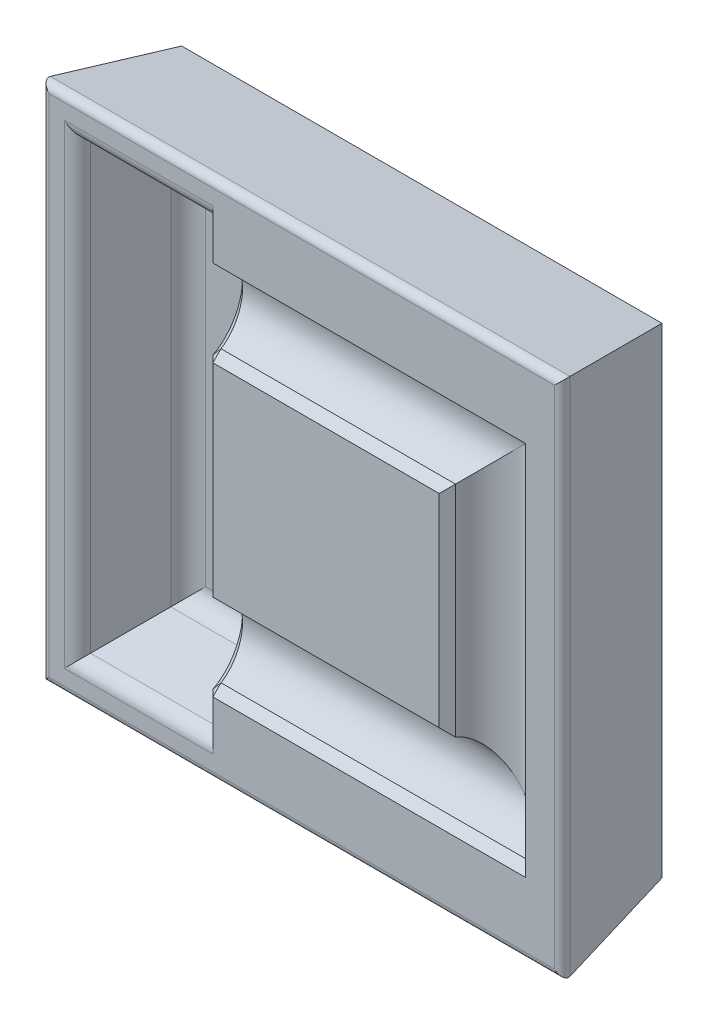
ISO-10303-21;
HEADER;
FILE_DESCRIPTION(('STEP AP214'),'2;1');
FILE_NAME('part.step','',(''),(''),'','','');
FILE_SCHEMA(('AUTOMOTIVE_DESIGN { 1 0 10303 214 1 1 1 1 }'));
ENDSEC;
DATA;
#1=APPLICATION_CONTEXT('core data for automotive mechanical design processes');
#2=APPLICATION_PROTOCOL_DEFINITION('international standard','automotive_design',2000,#1);
#3=PRODUCT_CONTEXT('',#1,'mechanical');
#4=PRODUCT('Part','Part','',(#3));
#5=PRODUCT_RELATED_PRODUCT_CATEGORY('part','',(#4));
#6=PRODUCT_DEFINITION_FORMATION('','',#4);
#7=PRODUCT_DEFINITION_CONTEXT('part definition',#1,'design');
#8=PRODUCT_DEFINITION('design','',#6,#7);
#9=PRODUCT_DEFINITION_SHAPE('','',#8);
#10=(LENGTH_UNIT() NAMED_UNIT(*) SI_UNIT(.MILLI.,.METRE.));
#11=(NAMED_UNIT(*) PLANE_ANGLE_UNIT() SI_UNIT($,.RADIAN.));
#12=(NAMED_UNIT(*) SI_UNIT($,.STERADIAN.) SOLID_ANGLE_UNIT());
#13=UNCERTAINTY_MEASURE_WITH_UNIT(LENGTH_MEASURE(1.E-05),#10,'distance_accuracy_value','');
#14=(GEOMETRIC_REPRESENTATION_CONTEXT(3) GLOBAL_UNCERTAINTY_ASSIGNED_CONTEXT((#13)) GLOBAL_UNIT_ASSIGNED_CONTEXT((#10,
#11,#12)) REPRESENTATION_CONTEXT('',''));
#15=CARTESIAN_POINT('',(0.,0.,0.));
#16=DIRECTION('',(0.,0.,1.));
#17=DIRECTION('',(1.,0.,0.));
#18=AXIS2_PLACEMENT_3D('',#15,#16,#17);
#19=CARTESIAN_POINT('',(-100.,-100.,50.));
#20=DIRECTION('',(0.,0.,1.));
#21=DIRECTION('',(1.,0.,0.));
#22=AXIS2_PLACEMENT_3D('',#19,#20,#21);
#23=PLANE('',#22);
#24=DIRECTION('',(0.,-1.,0.));
#25=VECTOR('',#24,1.);
#26=CARTESIAN_POINT('',(-37.,-98.8509468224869,50.));
#27=LINE('',#26,#25);
#28=CARTESIAN_POINT('',(-37.,-78.2410882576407,50.));
#29=VERTEX_POINT('',#28);
#30=CARTESIAN_POINT('',(-37.,-98.8509468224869,50.));
#31=VERTEX_POINT('',#30);
#32=EDGE_CURVE('E727',#29,#31,#27,.T.);
#33=ORIENTED_EDGE('',*,*,#32,.T.);
#34=DIRECTION('',(1.,0.,0.));
#35=VECTOR('',#34,1.);
#36=CARTESIAN_POINT('',(-93.8163490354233,-98.8509468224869,50.));
#37=LINE('',#36,#35);
#38=CARTESIAN_POINT('',(-98.8509468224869,-98.8509468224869,50.));
#39=VERTEX_POINT('',#38);
#40=EDGE_CURVE('E564',#31,#39,#37,.F.);
#41=ORIENTED_EDGE('',*,*,#40,.T.);
#42=DIRECTION('',(0.,-1.,0.));
#43=VECTOR('',#42,1.);
#44=CARTESIAN_POINT('',(-98.850946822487,93.8163490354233,50.));
#45=LINE('',#44,#43);
#46=CARTESIAN_POINT('',(-98.850946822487,98.8509468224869,50.));
#47=VERTEX_POINT('',#46);
#48=EDGE_CURVE('E531',#39,#47,#45,.F.);
#49=ORIENTED_EDGE('',*,*,#48,.T.);
#50=DIRECTION('',(-1.,0.,0.));
#51=VECTOR('',#50,1.);
#52=CARTESIAN_POINT('',(-40.,98.8509468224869,50.));
#53=LINE('',#52,#51);
#54=CARTESIAN_POINT('',(-37.,98.8509468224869,50.));
#55=VERTEX_POINT('',#54);
#56=EDGE_CURVE('E562',#47,#55,#53,.F.);
#57=ORIENTED_EDGE('',*,*,#56,.T.);
#58=DIRECTION('',(0.,-1.,0.));
#59=VECTOR('',#58,1.);
#60=CARTESIAN_POINT('',(-37.,75.2410882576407,50.));
#61=LINE('',#60,#59);
#62=CARTESIAN_POINT('',(-37.,78.2410882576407,50.));
#63=VERTEX_POINT('',#62);
#64=EDGE_CURVE('E1107',#55,#63,#61,.T.);
#65=ORIENTED_EDGE('',*,*,#64,.T.);
#66=DIRECTION('',(1.,0.,0.));
#67=VECTOR('',#66,1.);
#68=CARTESIAN_POINT('',(90.2410882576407,78.2410882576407,50.));
#69=LINE('',#68,#67);
#70=CARTESIAN_POINT('',(93.2410882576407,78.2410882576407,50.));
#71=VERTEX_POINT('',#70);
#72=EDGE_CURVE('E1105',#63,#71,#69,.T.);
#73=ORIENTED_EDGE('',*,*,#72,.T.);
#74=DIRECTION('',(0.,-1.,0.));
#75=VECTOR('',#74,1.);
#76=CARTESIAN_POINT('',(93.2410882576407,-100.,50.));
#77=LINE('',#76,#75);
#78=CARTESIAN_POINT('',(93.2410882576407,-78.2410882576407,50.));
#79=VERTEX_POINT('',#78);
#80=EDGE_CURVE('E953',#71,#79,#77,.T.);
#81=ORIENTED_EDGE('',*,*,#80,.T.);
#82=DIRECTION('',(-1.,0.,0.));
#83=VECTOR('',#82,1.);
#84=CARTESIAN_POINT('',(-40.,-78.2410882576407,50.));
#85=LINE('',#84,#83);
#86=EDGE_CURVE('E949',#79,#29,#85,.T.);
#87=ORIENTED_EDGE('',*,*,#86,.T.);
#88=EDGE_LOOP('',(#33,#41,#49,#57,#65,#73,#81,#87));
#89=FACE_BOUND('',#88,.T.);
#90=DIRECTION('',(1.,0.,0.));
#91=VECTOR('',#90,1.);
#92=CARTESIAN_POINT('',(-108.816349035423,105.241088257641,50.));
#93=LINE('',#92,#91);
#94=CARTESIAN_POINT('',(105.241088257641,105.241088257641,50.));
#95=VERTEX_POINT('',#94);
#96=CARTESIAN_POINT('',(-105.241088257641,105.241088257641,50.));
#97=VERTEX_POINT('',#96);
#98=EDGE_CURVE('E566',#95,#97,#93,.F.);
#99=ORIENTED_EDGE('',*,*,#98,.T.);
#100=DIRECTION('',(0.,1.,0.));
#101=VECTOR('',#100,1.);
#102=CARTESIAN_POINT('',(-105.241088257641,-108.816349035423,50.));
#103=LINE('',#102,#101);
#104=CARTESIAN_POINT('',(-105.241088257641,-105.241088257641,50.));
#105=VERTEX_POINT('',#104);
#106=EDGE_CURVE('E572',#97,#105,#103,.F.);
#107=ORIENTED_EDGE('',*,*,#106,.T.);
#108=DIRECTION('',(-1.,0.,0.));
#109=VECTOR('',#108,1.);
#110=CARTESIAN_POINT('',(108.816349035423,-105.241088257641,50.));
#111=LINE('',#110,#109);
#112=CARTESIAN_POINT('',(105.241088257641,-105.241088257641,50.));
#113=VERTEX_POINT('',#112);
#114=EDGE_CURVE('E570',#105,#113,#111,.F.);
#115=ORIENTED_EDGE('',*,*,#114,.T.);
#116=DIRECTION('',(0.,-1.,0.));
#117=VECTOR('',#116,1.);
#118=CARTESIAN_POINT('',(105.241088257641,108.816349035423,50.));
#119=LINE('',#118,#117);
#120=EDGE_CURVE('E568',#113,#95,#119,.F.);
#121=ORIENTED_EDGE('',*,*,#120,.T.);
#122=EDGE_LOOP('',(#99,#107,#115,#121));
#123=FACE_BOUND('',#122,.T.);
#124=ADVANCED_FACE('F352',(#89,#123),#23,.T.);
#125=CARTESIAN_POINT('',(-100.,100.,0.));
#126=DIRECTION('',(-0.984807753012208,0.,-0.173648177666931));
#127=DIRECTION('',(-0.173648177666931,0.,0.984807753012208));
#128=AXIS2_PLACEMENT_3D('',#125,#126,#127);
#129=PLANE('',#128);
#130=DIRECTION('',(0.171087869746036,0.171087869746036,-0.970287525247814));
#131=VECTOR('',#130,1.);
#132=CARTESIAN_POINT('',(-100.,-100.,0.));
#133=LINE('',#132,#131);
#134=CARTESIAN_POINT('',(-108.195511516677,-108.195511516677,46.4790554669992));
#135=VERTEX_POINT('',#134);
#136=CARTESIAN_POINT('',(-100.,-100.,0.));
#137=VERTEX_POINT('',#136);
#138=EDGE_CURVE('E520',#135,#137,#133,.T.);
#139=ORIENTED_EDGE('',*,*,#138,.F.);
#140=DIRECTION('',(0.,-1.,0.));
#141=VECTOR('',#140,1.);
#142=CARTESIAN_POINT('',(-108.195511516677,108.816349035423,46.4790554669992));
#143=LINE('',#142,#141);
#144=CARTESIAN_POINT('',(-108.195511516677,108.195511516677,46.4790554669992));
#145=VERTEX_POINT('',#144);
#146=EDGE_CURVE('E575',#135,#145,#143,.F.);
#147=ORIENTED_EDGE('',*,*,#146,.T.);
#148=DIRECTION('',(0.171087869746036,-0.171087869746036,-0.970287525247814));
#149=VECTOR('',#148,1.);
#150=CARTESIAN_POINT('',(-100.,100.,0.));
#151=LINE('',#150,#149);
#152=CARTESIAN_POINT('',(-100.,100.,0.));
#153=VERTEX_POINT('',#152);
#154=EDGE_CURVE('E544',#145,#153,#151,.T.);
#155=ORIENTED_EDGE('',*,*,#154,.T.);
#156=DIRECTION('',(0.,-1.,0.));
#157=VECTOR('',#156,1.);
#158=CARTESIAN_POINT('',(-100.,100.,0.));
#159=LINE('',#158,#157);
#160=EDGE_CURVE('E538',#153,#137,#159,.T.);
#161=ORIENTED_EDGE('',*,*,#160,.T.);
#162=EDGE_LOOP('',(#139,#147,#155,#161));
#163=FACE_BOUND('',#162,.T.);
#164=ADVANCED_FACE('F542',(#163),#129,.T.);
#165=CARTESIAN_POINT('',(-100.,-100.,0.));
#166=DIRECTION('',(0.,-0.984807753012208,-0.173648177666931));
#167=DIRECTION('',(0.,0.173648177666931,-0.984807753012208));
#168=AXIS2_PLACEMENT_3D('',#165,#166,#167);
#169=PLANE('',#168);
#170=DIRECTION('',(-0.171087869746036,0.171087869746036,-0.970287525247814));
#171=VECTOR('',#170,1.);
#172=CARTESIAN_POINT('',(94.1457881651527,-94.1457881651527,-33.2008851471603));
#173=LINE('',#172,#171);
#174=CARTESIAN_POINT('',(108.195511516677,-108.195511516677,46.4790554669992));
#175=VERTEX_POINT('',#174);
#176=CARTESIAN_POINT('',(100.,-100.,0.));
#177=VERTEX_POINT('',#176);
#178=EDGE_CURVE('E532',#175,#177,#173,.T.);
#179=ORIENTED_EDGE('',*,*,#178,.F.);
#180=DIRECTION('',(1.,0.,0.));
#181=VECTOR('',#180,1.);
#182=CARTESIAN_POINT('',(-108.816349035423,-108.195511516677,46.4790554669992));
#183=LINE('',#182,#181);
#184=EDGE_CURVE('E526',#175,#135,#183,.F.);
#185=ORIENTED_EDGE('',*,*,#184,.T.);
#186=ORIENTED_EDGE('',*,*,#138,.T.);
#187=DIRECTION('',(1.,0.,0.));
#188=VECTOR('',#187,1.);
#189=CARTESIAN_POINT('',(-100.,-100.,0.));
#190=LINE('',#189,#188);
#191=EDGE_CURVE('E523',#137,#177,#190,.T.);
#192=ORIENTED_EDGE('',*,*,#191,.T.);
#193=EDGE_LOOP('',(#179,#185,#186,#192));
#194=FACE_BOUND('',#193,.T.);
#195=ADVANCED_FACE('F354',(#194),#169,.T.);
#196=CARTESIAN_POINT('',(100.,100.,0.));
#197=DIRECTION('',(0.984807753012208,0.,-0.173648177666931));
#198=DIRECTION('',(-0.173648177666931,0.,-0.984807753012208));
#199=AXIS2_PLACEMENT_3D('',#196,#197,#198);
#200=PLANE('',#199);
#201=DIRECTION('',(-0.171087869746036,-0.171087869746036,-0.970287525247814));
#202=VECTOR('',#201,1.);
#203=CARTESIAN_POINT('',(94.1457881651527,94.1457881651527,-33.2008851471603));
#204=LINE('',#203,#202);
#205=CARTESIAN_POINT('',(108.195511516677,108.195511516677,46.4790554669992));
#206=VERTEX_POINT('',#205);
#207=CARTESIAN_POINT('',(100.,100.,0.));
#208=VERTEX_POINT('',#207);
#209=EDGE_CURVE('E558',#206,#208,#204,.T.);
#210=ORIENTED_EDGE('',*,*,#209,.F.);
#211=DIRECTION('',(0.,1.,0.));
#212=VECTOR('',#211,1.);
#213=CARTESIAN_POINT('',(108.195511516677,-108.816349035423,46.4790554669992));
#214=LINE('',#213,#212);
#215=EDGE_CURVE('E578',#206,#175,#214,.F.);
#216=ORIENTED_EDGE('',*,*,#215,.T.);
#217=ORIENTED_EDGE('',*,*,#178,.T.);
#218=DIRECTION('',(0.,1.,0.));
#219=VECTOR('',#218,1.);
#220=CARTESIAN_POINT('',(100.,100.,0.));
#221=LINE('',#220,#219);
#222=EDGE_CURVE('E540',#177,#208,#221,.T.);
#223=ORIENTED_EDGE('',*,*,#222,.T.);
#224=EDGE_LOOP('',(#210,#216,#217,#223));
#225=FACE_BOUND('',#224,.T.);
#226=ADVANCED_FACE('F1073',(#225),#200,.T.);
#227=CARTESIAN_POINT('',(-100.,100.,0.));
#228=DIRECTION('',(0.,0.984807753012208,-0.173648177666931));
#229=DIRECTION('',(0.,0.173648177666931,0.984807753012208));
#230=AXIS2_PLACEMENT_3D('',#227,#228,#229);
#231=PLANE('',#230);
#232=ORIENTED_EDGE('',*,*,#154,.F.);
#233=DIRECTION('',(-1.,0.,0.));
#234=VECTOR('',#233,1.);
#235=CARTESIAN_POINT('',(108.816349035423,108.195511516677,46.4790554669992));
#236=LINE('',#235,#234);
#237=EDGE_CURVE('E580',#145,#206,#236,.F.);
#238=ORIENTED_EDGE('',*,*,#237,.T.);
#239=ORIENTED_EDGE('',*,*,#209,.T.);
#240=DIRECTION('',(-1.,0.,0.));
#241=VECTOR('',#240,1.);
#242=CARTESIAN_POINT('',(-100.,100.,0.));
#243=LINE('',#242,#241);
#244=EDGE_CURVE('E555',#208,#153,#243,.T.);
#245=ORIENTED_EDGE('',*,*,#244,.T.);
#246=EDGE_LOOP('',(#232,#238,#239,#245));
#247=FACE_BOUND('',#246,.T.);
#248=ADVANCED_FACE('F1067',(#247),#231,.T.);
#249=DIRECTION('',(0.,-1.,0.));
#250=VECTOR('',#249,1.);
#251=CARTESIAN_POINT('',(-37.,-45.2410882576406,50.));
#252=LINE('',#251,#250);
#253=CARTESIAN_POINT('',(-37.,42.2410882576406,50.));
#254=VERTEX_POINT('',#253);
#255=CARTESIAN_POINT('',(-37.,-42.2410882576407,50.));
#256=VERTEX_POINT('',#255);
#257=EDGE_CURVE('E1009',#254,#256,#252,.T.);
#258=ORIENTED_EDGE('',*,*,#257,.T.);
#259=DIRECTION('',(1.,0.,0.));
#260=VECTOR('',#259,1.);
#261=CARTESIAN_POINT('',(60.2410882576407,-42.2410882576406,50.));
#262=LINE('',#261,#260);
#263=CARTESIAN_POINT('',(57.2410882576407,-42.2410882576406,50.));
#264=VERTEX_POINT('',#263);
#265=EDGE_CURVE('E1020',#256,#264,#262,.T.);
#266=ORIENTED_EDGE('',*,*,#265,.T.);
#267=DIRECTION('',(0.,1.,0.));
#268=VECTOR('',#267,1.);
#269=CARTESIAN_POINT('',(57.2410882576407,-100.,50.));
#270=LINE('',#269,#268);
#271=CARTESIAN_POINT('',(57.2410882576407,42.2410882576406,50.));
#272=VERTEX_POINT('',#271);
#273=EDGE_CURVE('E1018',#264,#272,#270,.T.);
#274=ORIENTED_EDGE('',*,*,#273,.T.);
#275=DIRECTION('',(-1.,0.,0.));
#276=VECTOR('',#275,1.);
#277=CARTESIAN_POINT('',(-40.,42.2410882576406,50.));
#278=LINE('',#277,#276);
#279=EDGE_CURVE('E1011',#272,#254,#278,.T.);
#280=ORIENTED_EDGE('',*,*,#279,.T.);
#281=EDGE_LOOP('',(#258,#266,#274,#280));
#282=FACE_BOUND('',#281,.T.);
#283=ADVANCED_FACE('F1061',(#282),#23,.T.);
#284=CARTESIAN_POINT('',(-100.,-100.,0.));
#285=DIRECTION('',(0.,0.,1.));
#286=DIRECTION('',(1.,0.,0.));
#287=AXIS2_PLACEMENT_3D('',#284,#285,#286);
#288=PLANE('',#287);
#289=ORIENTED_EDGE('',*,*,#160,.F.);
#290=ORIENTED_EDGE('',*,*,#244,.F.);
#291=ORIENTED_EDGE('',*,*,#222,.F.);
#292=ORIENTED_EDGE('',*,*,#191,.F.);
#293=EDGE_LOOP('',(#289,#290,#291,#292));
#294=FACE_BOUND('',#293,.T.);
#295=ADVANCED_FACE('F536',(#294),#288,.F.);
#296=CARTESIAN_POINT('',(-93.8163490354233,93.8163490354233,50.));
#297=DIRECTION('',(-0.984807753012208,0.,-0.173648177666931));
#298=DIRECTION('',(-0.173648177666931,0.,0.984807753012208));
#299=AXIS2_PLACEMENT_3D('',#296,#297,#298);
#300=PLANE('',#299);
#301=DIRECTION('',(-0.171087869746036,0.171087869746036,0.970287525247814));
#302=VECTOR('',#301,1.);
#303=CARTESIAN_POINT('',(-93.8163490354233,93.8163490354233,50.));
#304=LINE('',#303,#302);
#305=CARTESIAN_POINT('',(-87.9289347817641,87.9289347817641,16.6108145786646));
#306=VERTEX_POINT('',#305);
#307=CARTESIAN_POINT('',(-92.9421003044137,92.9421003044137,45.0418890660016));
#308=VERTEX_POINT('',#307);
#309=EDGE_CURVE('E546',#306,#308,#304,.T.);
#310=ORIENTED_EDGE('',*,*,#309,.T.);
#311=DIRECTION('',(0.,-1.,0.));
#312=VECTOR('',#311,1.);
#313=CARTESIAN_POINT('',(-92.9421003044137,-93.8163490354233,45.0418890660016));
#314=LINE('',#313,#312);
#315=CARTESIAN_POINT('',(-92.9421003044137,-92.9421003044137,45.0418890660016));
#316=VERTEX_POINT('',#315);
#317=EDGE_CURVE('E593',#308,#316,#314,.T.);
#318=ORIENTED_EDGE('',*,*,#317,.T.);
#319=DIRECTION('',(-0.171087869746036,-0.171087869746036,0.970287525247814));
#320=VECTOR('',#319,1.);
#321=CARTESIAN_POINT('',(-88.3241412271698,-88.3241412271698,18.8521417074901));
#322=LINE('',#321,#320);
#323=CARTESIAN_POINT('',(-87.9289347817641,-87.9289347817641,16.6108145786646));
#324=VERTEX_POINT('',#323);
#325=EDGE_CURVE('E918',#324,#316,#322,.T.);
#326=ORIENTED_EDGE('',*,*,#325,.F.);
#327=DIRECTION('',(0.,-1.,0.));
#328=VECTOR('',#327,1.);
#329=CARTESIAN_POINT('',(-87.9289347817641,93.8163490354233,16.6108145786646));
#330=LINE('',#329,#328);
#331=EDGE_CURVE('E591',#324,#306,#330,.F.);
#332=ORIENTED_EDGE('',*,*,#331,.T.);
#333=EDGE_LOOP('',(#310,#318,#326,#332));
#334=FACE_BOUND('',#333,.T.);
#335=ADVANCED_FACE('F684',(#334),#300,.F.);
#336=CARTESIAN_POINT('',(-93.8163490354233,93.8163490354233,50.));
#337=DIRECTION('',(0.,0.984807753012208,-0.173648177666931));
#338=DIRECTION('',(0.,0.173648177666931,0.984807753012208));
#339=AXIS2_PLACEMENT_3D('',#336,#337,#338);
#340=PLANE('',#339);
#341=DIRECTION('',(0.171087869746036,0.171087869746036,0.970287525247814));
#342=VECTOR('',#341,1.);
#343=CARTESIAN_POINT('',(-40.,93.8163490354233,50.));
#344=LINE('',#343,#342);
#345=CARTESIAN_POINT('',(-45.8874142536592,87.9289347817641,16.6108145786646));
#346=VERTEX_POINT('',#345);
#347=CARTESIAN_POINT('',(-40.8742487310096,92.9421003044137,45.0418890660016));
#348=VERTEX_POINT('',#347);
#349=EDGE_CURVE('E549',#346,#348,#344,.T.);
#350=ORIENTED_EDGE('',*,*,#349,.T.);
#351=DIRECTION('',(-1.,0.,0.));
#352=VECTOR('',#351,1.);
#353=CARTESIAN_POINT('',(-93.8163490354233,92.9421003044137,45.0418890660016));
#354=LINE('',#353,#352);
#355=EDGE_CURVE('E589',#348,#308,#354,.T.);
#356=ORIENTED_EDGE('',*,*,#355,.T.);
#357=ORIENTED_EDGE('',*,*,#309,.F.);
#358=DIRECTION('',(-1.,0.,0.));
#359=VECTOR('',#358,1.);
#360=CARTESIAN_POINT('',(-93.8163490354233,87.9289347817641,16.6108145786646));
#361=LINE('',#360,#359);
#362=EDGE_CURVE('E587',#306,#346,#361,.F.);
#363=ORIENTED_EDGE('',*,*,#362,.T.);
#364=EDGE_LOOP('',(#350,#356,#357,#363));
#365=FACE_BOUND('',#364,.T.);
#366=ADVANCED_FACE('F687',(#365),#340,.F.);
#367=CARTESIAN_POINT('',(-40.,93.8163490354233,50.));
#368=DIRECTION('',(0.984807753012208,0.,-0.173648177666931));
#369=DIRECTION('',(-0.173648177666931,0.,-0.984807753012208));
#370=AXIS2_PLACEMENT_3D('',#367,#368,#369);
#371=PLANE('',#370);
#372=CARTESIAN_POINT('',(-41.0579618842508,-98.8509468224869,44.));
#373=DIRECTION('',(0.984807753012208,0.,-0.173648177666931));
#374=DIRECTION('',(-0.173648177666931,0.,-0.984807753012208));
#375=AXIS2_PLACEMENT_3D('',#372,#373,#374);
#376=ELLIPSE('',#375,6.09255967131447,6.);
#377=CARTESIAN_POINT('',(-40.8742487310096,-92.9421003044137,45.0418890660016));
#378=VERTEX_POINT('',#377);
#379=CARTESIAN_POINT('',(-40.6422220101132,-93.3336211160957,46.3577779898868));
#380=VERTEX_POINT('',#379);
#381=EDGE_CURVE('E607',#378,#380,#376,.T.);
#382=ORIENTED_EDGE('',*,*,#381,.T.);
#383=DIRECTION('',(0.,1.,0.));
#384=VECTOR('',#383,1.);
#385=CARTESIAN_POINT('',(-40.6422220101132,-75.2410882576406,46.3577779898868));
#386=LINE('',#385,#384);
#387=CARTESIAN_POINT('',(-40.6422633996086,-79.04462382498,46.3575432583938));
#388=VERTEX_POINT('',#387);
#389=EDGE_CURVE('E367',#380,#388,#386,.T.);
#390=ORIENTED_EDGE('',*,*,#389,.T.);
#391=CARTESIAN_POINT('',(-40.1902283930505,-41.0335967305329,48.9211611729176));
#392=CARTESIAN_POINT('',(-41.0276289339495,-41.4427463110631,44.1720267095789));
#393=CARTESIAN_POINT('',(-41.8291016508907,-43.7115553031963,39.6266490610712));
#394=CARTESIAN_POINT('',(-42.6797222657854,-48.9856705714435,34.8025398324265));
#395=CARTESIAN_POINT('',(-42.9046233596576,-51.0416483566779,33.5270623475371));
#396=CARTESIAN_POINT('',(-43.2085258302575,-55.480556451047,31.8035457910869));
#397=CARTESIAN_POINT('',(-43.2871267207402,-57.8602053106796,31.3577779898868));
#398=CARTESIAN_POINT('',(-43.2871267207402,-62.6219712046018,31.3577779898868));
#399=CARTESIAN_POINT('',(-43.2085258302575,-65.0016200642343,31.8035457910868));
#400=CARTESIAN_POINT('',(-42.9046233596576,-69.4405281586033,33.527062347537));
#401=CARTESIAN_POINT('',(-42.6797222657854,-71.4965059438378,34.8025398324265));
#402=CARTESIAN_POINT('',(-41.8291016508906,-76.7706212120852,39.6266490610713));
#403=CARTESIAN_POINT('',(-41.0276289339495,-79.0394302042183,44.172026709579));
#404=CARTESIAN_POINT('',(-40.1902283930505,-79.4485797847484,48.9211611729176));
#405=B_SPLINE_CURVE_WITH_KNOTS('',3,(#391,#392,#393,#394,#395,#396,#397,#398,#399,#400,#401,
#402,#403,#404),.UNSPECIFIED.,.F.,.F.,(4,2,2,2,2,2,4),(4.80175394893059,5.54246962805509,
5.91282746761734,6.28318530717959,6.65354314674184,7.02390098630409,7.76461666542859),.UNSPECIFIED.);
#406=CARTESIAN_POINT('',(-40.6422327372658,-41.437462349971,46.3576705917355));
#407=VERTEX_POINT('',#406);
#408=EDGE_CURVE('E372',#388,#407,#405,.F.);
#409=ORIENTED_EDGE('',*,*,#408,.T.);
#410=DIRECTION('',(0.,1.,0.));
#411=VECTOR('',#410,1.);
#412=CARTESIAN_POINT('',(-40.6422220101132,45.2410882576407,46.3577779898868));
#413=LINE('',#412,#411);
#414=CARTESIAN_POINT('',(-40.6422427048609,41.438079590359,46.3576606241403));
#415=VERTEX_POINT('',#414);
#416=EDGE_CURVE('E752',#407,#415,#413,.T.);
#417=ORIENTED_EDGE('',*,*,#416,.T.);
#418=CARTESIAN_POINT('',(-40.1902283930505,79.4485797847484,48.9211611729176));
#419=CARTESIAN_POINT('',(-41.0276289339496,79.0394302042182,44.1720267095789));
#420=CARTESIAN_POINT('',(-41.8291016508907,76.770621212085,39.6266490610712));
#421=CARTESIAN_POINT('',(-42.6797222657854,71.4965059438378,34.8025398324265));
#422=CARTESIAN_POINT('',(-42.9046233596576,69.4405281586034,33.5270623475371));
#423=CARTESIAN_POINT('',(-43.2085258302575,65.0016200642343,31.8035457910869));
#424=CARTESIAN_POINT('',(-43.2871267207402,62.6219712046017,31.3577779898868));
#425=CARTESIAN_POINT('',(-43.2871267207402,57.8602053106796,31.3577779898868));
#426=CARTESIAN_POINT('',(-43.2085258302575,55.4805564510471,31.8035457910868));
#427=CARTESIAN_POINT('',(-42.9046233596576,51.041648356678,33.527062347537));
#428=CARTESIAN_POINT('',(-42.6797222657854,48.9856705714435,34.8025398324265));
#429=CARTESIAN_POINT('',(-41.8291016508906,43.7115553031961,39.6266490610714));
#430=CARTESIAN_POINT('',(-41.0276289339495,41.4427463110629,44.172026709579));
#431=CARTESIAN_POINT('',(-40.1902283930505,41.0335967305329,48.9211611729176));
#432=B_SPLINE_CURVE_WITH_KNOTS('',3,(#418,#419,#420,#421,#422,#423,#424,#425,#426,#427,#428,
#429,#430,#431),.UNSPECIFIED.,.F.,.F.,(4,2,2,2,2,2,4),(4.80175394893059,5.54246962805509,
5.91282746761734,6.28318530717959,6.65354314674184,7.02390098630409,7.76461666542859),.UNSPECIFIED.);
#433=CARTESIAN_POINT('',(-40.6422633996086,79.04462382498,46.3575432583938));
#434=VERTEX_POINT('',#433);
#435=EDGE_CURVE('E878',#415,#434,#432,.F.);
#436=ORIENTED_EDGE('',*,*,#435,.T.);
#437=DIRECTION('',(0.,1.,0.));
#438=VECTOR('',#437,1.);
#439=CARTESIAN_POINT('',(-40.6422220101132,98.8509468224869,46.3577779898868));
#440=LINE('',#439,#438);
#441=CARTESIAN_POINT('',(-40.6422220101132,93.3336211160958,46.3577779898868));
#442=VERTEX_POINT('',#441);
#443=EDGE_CURVE('E950',#434,#442,#440,.T.);
#444=ORIENTED_EDGE('',*,*,#443,.T.);
#445=CARTESIAN_POINT('',(-41.0579618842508,98.8509468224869,44.));
#446=DIRECTION('',(0.984807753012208,0.,-0.173648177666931));
#447=DIRECTION('',(0.173648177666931,0.,0.984807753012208));
#448=AXIS2_PLACEMENT_3D('',#445,#446,#447);
#449=ELLIPSE('',#448,6.09255967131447,6.);
#450=EDGE_CURVE('E609',#442,#348,#449,.T.);
#451=ORIENTED_EDGE('',*,*,#450,.T.);
#452=ORIENTED_EDGE('',*,*,#349,.F.);
#453=DIRECTION('',(0.,1.,0.));
#454=VECTOR('',#453,1.);
#455=CARTESIAN_POINT('',(-45.8874142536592,93.8163490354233,16.6108145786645));
#456=LINE('',#455,#454);
#457=CARTESIAN_POINT('',(-45.8874142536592,-87.9289347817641,16.6108145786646));
#458=VERTEX_POINT('',#457);
#459=EDGE_CURVE('E604',#346,#458,#456,.F.);
#460=ORIENTED_EDGE('',*,*,#459,.T.);
#461=DIRECTION('',(0.171087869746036,-0.171087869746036,0.970287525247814));
#462=VECTOR('',#461,1.);
#463=CARTESIAN_POINT('',(-41.5752615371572,-92.241087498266,41.0662478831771));
#464=LINE('',#463,#462);
#465=EDGE_CURVE('E723',#458,#378,#464,.T.);
#466=ORIENTED_EDGE('',*,*,#465,.T.);
#467=EDGE_LOOP('',(#382,#390,#409,#417,#436,#444,#451,#452,#460,#466));
#468=FACE_BOUND('',#467,.T.);
#469=ADVANCED_FACE('F691',(#468),#371,.F.);
#470=CARTESIAN_POINT('',(-93.8163490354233,-93.8163490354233,50.));
#471=DIRECTION('',(0.,-0.984807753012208,-0.173648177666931));
#472=DIRECTION('',(0.,0.173648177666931,-0.984807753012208));
#473=AXIS2_PLACEMENT_3D('',#470,#471,#472);
#474=PLANE('',#473);
#475=ORIENTED_EDGE('',*,*,#325,.T.);
#476=DIRECTION('',(1.,0.,0.));
#477=VECTOR('',#476,1.);
#478=CARTESIAN_POINT('',(-40.,-92.9421003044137,45.0418890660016));
#479=LINE('',#478,#477);
#480=EDGE_CURVE('E584',#316,#378,#479,.T.);
#481=ORIENTED_EDGE('',*,*,#480,.T.);
#482=ORIENTED_EDGE('',*,*,#465,.F.);
#483=DIRECTION('',(1.,0.,0.));
#484=VECTOR('',#483,1.);
#485=CARTESIAN_POINT('',(-93.8163490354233,-87.9289347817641,16.6108145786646));
#486=LINE('',#485,#484);
#487=EDGE_CURVE('E582',#458,#324,#486,.F.);
#488=ORIENTED_EDGE('',*,*,#487,.T.);
#489=EDGE_LOOP('',(#475,#481,#482,#488));
#490=FACE_BOUND('',#489,.T.);
#491=ADVANCED_FACE('F682',(#490),#474,.F.);
#492=CARTESIAN_POINT('',(-93.8163490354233,-93.8163490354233,10.));
#493=DIRECTION('',(0.,0.,1.));
#494=DIRECTION('',(1.,0.,0.));
#495=AXIS2_PLACEMENT_3D('',#492,#493,#494);
#496=PLANE('',#495);
#497=DIRECTION('',(1.,0.,0.));
#498=VECTOR('',#497,1.);
#499=CARTESIAN_POINT('',(-93.8163490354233,-80.0504727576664,10.));
#500=LINE('',#499,#498);
#501=CARTESIAN_POINT('',(-80.0504727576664,-80.0504727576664,10.));
#502=VERTEX_POINT('',#501);
#503=CARTESIAN_POINT('',(-53.7658762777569,-80.0504727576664,10.));
#504=VERTEX_POINT('',#503);
#505=EDGE_CURVE('E599',#502,#504,#500,.T.);
#506=ORIENTED_EDGE('',*,*,#505,.T.);
#507=DIRECTION('',(0.,1.,0.));
#508=VECTOR('',#507,1.);
#509=CARTESIAN_POINT('',(-53.7658762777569,-93.8163490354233,10.));
#510=LINE('',#509,#508);
#511=CARTESIAN_POINT('',(-53.7658762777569,80.0504727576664,10.));
#512=VERTEX_POINT('',#511);
#513=EDGE_CURVE('E601',#504,#512,#510,.T.);
#514=ORIENTED_EDGE('',*,*,#513,.T.);
#515=DIRECTION('',(-1.,0.,0.));
#516=VECTOR('',#515,1.);
#517=CARTESIAN_POINT('',(-93.8163490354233,80.0504727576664,10.));
#518=LINE('',#517,#516);
#519=CARTESIAN_POINT('',(-80.0504727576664,80.0504727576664,10.));
#520=VERTEX_POINT('',#519);
#521=EDGE_CURVE('E597',#512,#520,#518,.T.);
#522=ORIENTED_EDGE('',*,*,#521,.T.);
#523=DIRECTION('',(0.,-1.,0.));
#524=VECTOR('',#523,1.);
#525=CARTESIAN_POINT('',(-80.0504727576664,-93.8163490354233,10.));
#526=LINE('',#525,#524);
#527=EDGE_CURVE('E595',#520,#502,#526,.T.);
#528=ORIENTED_EDGE('',*,*,#527,.T.);
#529=EDGE_LOOP('',(#506,#514,#522,#528));
#530=FACE_BOUND('',#529,.T.);
#531=ADVANCED_FACE('F678',(#530),#496,.T.);
#532=CARTESIAN_POINT('',(105.241088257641,-100.,47.));
#533=DIRECTION('',(0.,1.,0.));
#534=DIRECTION('',(-1.,0.,0.));
#535=AXIS2_PLACEMENT_3D('',#532,#533,#534);
#536=CYLINDRICAL_SURFACE('',#535,3.);
#537=CARTESIAN_POINT('',(105.241088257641,-105.241088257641,47.));
#538=DIRECTION('',(0.707106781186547,0.707106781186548,0.));
#539=DIRECTION('',(-0.707106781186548,0.707106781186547,0.));
#540=AXIS2_PLACEMENT_3D('',#537,#538,#539);
#541=ELLIPSE('',#540,4.24264068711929,3.);
#542=EDGE_CURVE('E913',#175,#113,#541,.F.);
#543=ORIENTED_EDGE('',*,*,#542,.F.);
#544=ORIENTED_EDGE('',*,*,#215,.F.);
#545=CARTESIAN_POINT('',(105.241088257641,105.241088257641,47.));
#546=DIRECTION('',(-0.707106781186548,0.707106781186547,0.));
#547=DIRECTION('',(-0.707106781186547,-0.707106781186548,0.));
#548=AXIS2_PLACEMENT_3D('',#545,#546,#547);
#549=ELLIPSE('',#548,4.24264068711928,3.);
#550=EDGE_CURVE('E916',#95,#206,#549,.T.);
#551=ORIENTED_EDGE('',*,*,#550,.F.);
#552=ORIENTED_EDGE('',*,*,#120,.F.);
#553=EDGE_LOOP('',(#543,#544,#551,#552));
#554=FACE_BOUND('',#553,.T.);
#555=ADVANCED_FACE('F674',(#554),#536,.T.);
#556=CARTESIAN_POINT('',(-100.,105.241088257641,47.));
#557=DIRECTION('',(-1.,0.,0.));
#558=DIRECTION('',(0.,0.,1.));
#559=AXIS2_PLACEMENT_3D('',#556,#557,#558);
#560=CYLINDRICAL_SURFACE('',#559,3.);
#561=ORIENTED_EDGE('',*,*,#550,.T.);
#562=ORIENTED_EDGE('',*,*,#237,.F.);
#563=CARTESIAN_POINT('',(-105.241088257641,105.241088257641,47.));
#564=DIRECTION('',(-0.707106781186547,-0.707106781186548,0.));
#565=DIRECTION('',(-0.707106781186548,0.707106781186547,0.));
#566=AXIS2_PLACEMENT_3D('',#563,#564,#565);
#567=ELLIPSE('',#566,4.24264068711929,3.);
#568=EDGE_CURVE('E911',#97,#145,#567,.T.);
#569=ORIENTED_EDGE('',*,*,#568,.F.);
#570=ORIENTED_EDGE('',*,*,#98,.F.);
#571=EDGE_LOOP('',(#561,#562,#569,#570));
#572=FACE_BOUND('',#571,.T.);
#573=ADVANCED_FACE('F670',(#572),#560,.T.);
#574=CARTESIAN_POINT('',(-100.,-105.241088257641,47.));
#575=DIRECTION('',(1.,0.,0.));
#576=DIRECTION('',(0.,0.,-1.));
#577=AXIS2_PLACEMENT_3D('',#574,#575,#576);
#578=CYLINDRICAL_SURFACE('',#577,3.);
#579=ORIENTED_EDGE('',*,*,#542,.T.);
#580=ORIENTED_EDGE('',*,*,#114,.F.);
#581=CARTESIAN_POINT('',(-105.241088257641,-105.241088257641,47.));
#582=DIRECTION('',(0.707106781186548,-0.707106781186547,0.));
#583=DIRECTION('',(0.707106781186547,0.707106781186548,0.));
#584=AXIS2_PLACEMENT_3D('',#581,#582,#583);
#585=ELLIPSE('',#584,4.24264068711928,3.);
#586=EDGE_CURVE('E909',#135,#105,#585,.F.);
#587=ORIENTED_EDGE('',*,*,#586,.F.);
#588=ORIENTED_EDGE('',*,*,#184,.F.);
#589=EDGE_LOOP('',(#579,#580,#587,#588));
#590=FACE_BOUND('',#589,.T.);
#591=ADVANCED_FACE('F666',(#590),#578,.T.);
#592=CARTESIAN_POINT('',(-105.241088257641,-100.,47.));
#593=DIRECTION('',(0.,-1.,0.));
#594=DIRECTION('',(1.,0.,0.));
#595=AXIS2_PLACEMENT_3D('',#592,#593,#594);
#596=CYLINDRICAL_SURFACE('',#595,3.);
#597=ORIENTED_EDGE('',*,*,#568,.T.);
#598=ORIENTED_EDGE('',*,*,#146,.F.);
#599=ORIENTED_EDGE('',*,*,#586,.T.);
#600=ORIENTED_EDGE('',*,*,#106,.F.);
#601=EDGE_LOOP('',(#597,#598,#599,#600));
#602=FACE_BOUND('',#601,.T.);
#603=ADVANCED_FACE('F662',(#602),#596,.T.);
#604=CARTESIAN_POINT('',(-93.8163490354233,98.8509468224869,44.));
#605=DIRECTION('',(1.,0.,0.));
#606=DIRECTION('',(0.,0.,-1.));
#607=AXIS2_PLACEMENT_3D('',#604,#605,#606);
#608=CYLINDRICAL_SURFACE('',#607,6.);
#609=ORIENTED_EDGE('',*,*,#450,.F.);
#610=CARTESIAN_POINT('',(-43.,98.8509468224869,44.));
#611=DIRECTION('',(-0.707106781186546,0.,0.70710678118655));
#612=DIRECTION('',(0.70710678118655,0.,0.707106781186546));
#613=AXIS2_PLACEMENT_3D('',#610,#611,#612);
#614=ELLIPSE('',#613,8.48528137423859,6.);
#615=EDGE_CURVE('E12',#442,#55,#614,.T.);
#616=ORIENTED_EDGE('',*,*,#615,.T.);
#617=ORIENTED_EDGE('',*,*,#56,.F.);
#618=CARTESIAN_POINT('',(-98.850946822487,98.8509468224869,44.));
#619=DIRECTION('',(0.707106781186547,0.707106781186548,0.));
#620=DIRECTION('',(0.707106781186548,-0.707106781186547,0.));
#621=AXIS2_PLACEMENT_3D('',#618,#619,#620);
#622=ELLIPSE('',#621,8.48528137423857,6.);
#623=EDGE_CURVE('E906',#308,#47,#622,.F.);
#624=ORIENTED_EDGE('',*,*,#623,.F.);
#625=ORIENTED_EDGE('',*,*,#355,.F.);
#626=EDGE_LOOP('',(#609,#616,#617,#624,#625));
#627=FACE_BOUND('',#626,.T.);
#628=ADVANCED_FACE('F658',(#627),#608,.T.);
#629=CARTESIAN_POINT('',(-98.850946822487,93.8163490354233,44.));
#630=DIRECTION('',(0.,1.,0.));
#631=DIRECTION('',(-1.,0.,0.));
#632=AXIS2_PLACEMENT_3D('',#629,#630,#631);
#633=CYLINDRICAL_SURFACE('',#632,6.);
#634=ORIENTED_EDGE('',*,*,#623,.T.);
#635=ORIENTED_EDGE('',*,*,#48,.F.);
#636=CARTESIAN_POINT('',(-98.8509468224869,-98.8509468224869,44.));
#637=DIRECTION('',(-0.707106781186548,0.707106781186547,0.));
#638=DIRECTION('',(-0.707106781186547,-0.707106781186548,0.));
#639=AXIS2_PLACEMENT_3D('',#636,#637,#638);
#640=ELLIPSE('',#639,8.48528137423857,6.);
#641=EDGE_CURVE('E904',#316,#39,#640,.F.);
#642=ORIENTED_EDGE('',*,*,#641,.F.);
#643=ORIENTED_EDGE('',*,*,#317,.F.);
#644=EDGE_LOOP('',(#634,#635,#642,#643));
#645=FACE_BOUND('',#644,.T.);
#646=ADVANCED_FACE('F654',(#645),#633,.T.);
#647=CARTESIAN_POINT('',(-93.8163490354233,-98.8509468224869,44.));
#648=DIRECTION('',(-1.,0.,0.));
#649=DIRECTION('',(0.,0.,1.));
#650=AXIS2_PLACEMENT_3D('',#647,#648,#649);
#651=CYLINDRICAL_SURFACE('',#650,6.);
#652=ORIENTED_EDGE('',*,*,#641,.T.);
#653=ORIENTED_EDGE('',*,*,#40,.F.);
#654=CARTESIAN_POINT('',(-43.,-98.8509468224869,44.));
#655=DIRECTION('',(-0.707106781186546,0.,0.70710678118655));
#656=DIRECTION('',(-0.70710678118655,0.,-0.707106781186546));
#657=AXIS2_PLACEMENT_3D('',#654,#655,#656);
#658=ELLIPSE('',#657,8.48528137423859,6.);
#659=EDGE_CURVE('E360',#31,#380,#658,.T.);
#660=ORIENTED_EDGE('',*,*,#659,.T.);
#661=ORIENTED_EDGE('',*,*,#381,.F.);
#662=ORIENTED_EDGE('',*,*,#480,.F.);
#663=EDGE_LOOP('',(#652,#653,#660,#661,#662));
#664=FACE_BOUND('',#663,.T.);
#665=ADVANCED_FACE('F650',(#664),#651,.T.);
#666=CARTESIAN_POINT('',(-80.0504727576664,-93.8163490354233,18.));
#667=DIRECTION('',(0.,-1.,0.));
#668=DIRECTION('',(1.,0.,0.));
#669=AXIS2_PLACEMENT_3D('',#666,#667,#668);
#670=CYLINDRICAL_SURFACE('',#669,8.);
#671=CARTESIAN_POINT('',(-80.0504727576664,80.0504727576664,18.));
#672=DIRECTION('',(-0.707106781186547,-0.707106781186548,0.));
#673=DIRECTION('',(-0.707106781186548,0.707106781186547,0.));
#674=AXIS2_PLACEMENT_3D('',#671,#672,#673);
#675=ELLIPSE('',#674,11.3137084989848,8.);
#676=EDGE_CURVE('E898',#306,#520,#675,.T.);
#677=ORIENTED_EDGE('',*,*,#676,.F.);
#678=ORIENTED_EDGE('',*,*,#331,.F.);
#679=CARTESIAN_POINT('',(-80.0504727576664,-80.0504727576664,18.));
#680=DIRECTION('',(0.707106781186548,-0.707106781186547,0.));
#681=DIRECTION('',(0.707106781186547,0.707106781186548,0.));
#682=AXIS2_PLACEMENT_3D('',#679,#680,#681);
#683=ELLIPSE('',#682,11.3137084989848,8.);
#684=EDGE_CURVE('E901',#502,#324,#683,.F.);
#685=ORIENTED_EDGE('',*,*,#684,.F.);
#686=ORIENTED_EDGE('',*,*,#527,.F.);
#687=EDGE_LOOP('',(#677,#678,#685,#686));
#688=FACE_BOUND('',#687,.T.);
#689=ADVANCED_FACE('F646',(#688),#670,.F.);
#690=CARTESIAN_POINT('',(-93.8163490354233,-80.0504727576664,18.));
#691=DIRECTION('',(1.,0.,0.));
#692=DIRECTION('',(0.,0.,-1.));
#693=AXIS2_PLACEMENT_3D('',#690,#691,#692);
#694=CYLINDRICAL_SURFACE('',#693,8.);
#695=ORIENTED_EDGE('',*,*,#684,.T.);
#696=ORIENTED_EDGE('',*,*,#487,.F.);
#697=CARTESIAN_POINT('',(-53.7658762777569,-80.0504727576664,18.));
#698=DIRECTION('',(0.707106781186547,0.707106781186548,0.));
#699=DIRECTION('',(-0.707106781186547,0.707106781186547,0.));
#700=AXIS2_PLACEMENT_3D('',#697,#698,#699);
#701=ELLIPSE('',#700,11.3137084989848,8.);
#702=EDGE_CURVE('E896',#504,#458,#701,.F.);
#703=ORIENTED_EDGE('',*,*,#702,.F.);
#704=ORIENTED_EDGE('',*,*,#505,.F.);
#705=EDGE_LOOP('',(#695,#696,#703,#704));
#706=FACE_BOUND('',#705,.T.);
#707=ADVANCED_FACE('F642',(#706),#694,.F.);
#708=CARTESIAN_POINT('',(-93.8163490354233,80.0504727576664,18.));
#709=DIRECTION('',(-1.,0.,0.));
#710=DIRECTION('',(0.,0.,1.));
#711=AXIS2_PLACEMENT_3D('',#708,#709,#710);
#712=CYLINDRICAL_SURFACE('',#711,8.);
#713=ORIENTED_EDGE('',*,*,#676,.T.);
#714=ORIENTED_EDGE('',*,*,#521,.F.);
#715=CARTESIAN_POINT('',(-53.7658762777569,80.0504727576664,18.));
#716=DIRECTION('',(-0.707106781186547,0.707106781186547,0.));
#717=DIRECTION('',(0.707106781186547,0.707106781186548,0.));
#718=AXIS2_PLACEMENT_3D('',#715,#716,#717);
#719=ELLIPSE('',#718,11.3137084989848,8.);
#720=EDGE_CURVE('E894',#346,#512,#719,.T.);
#721=ORIENTED_EDGE('',*,*,#720,.F.);
#722=ORIENTED_EDGE('',*,*,#362,.F.);
#723=EDGE_LOOP('',(#713,#714,#721,#722));
#724=FACE_BOUND('',#723,.T.);
#725=ADVANCED_FACE('F638',(#724),#712,.F.);
#726=CARTESIAN_POINT('',(-53.7658762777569,-93.8163490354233,18.));
#727=DIRECTION('',(0.,1.,0.));
#728=DIRECTION('',(-1.,0.,0.));
#729=AXIS2_PLACEMENT_3D('',#726,#727,#728);
#730=CYLINDRICAL_SURFACE('',#729,8.);
#731=ORIENTED_EDGE('',*,*,#702,.T.);
#732=ORIENTED_EDGE('',*,*,#459,.F.);
#733=ORIENTED_EDGE('',*,*,#720,.T.);
#734=ORIENTED_EDGE('',*,*,#513,.F.);
#735=EDGE_LOOP('',(#731,#732,#733,#734));
#736=FACE_BOUND('',#735,.T.);
#737=ADVANCED_FACE('F634',(#736),#730,.F.);
#738=CARTESIAN_POINT('',(75.2410882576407,-60.2410882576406,50.));
#739=DIRECTION('',(-1.,0.,0.));
#740=DIRECTION('',(0.,-1.,0.));
#741=AXIS2_PLACEMENT_3D('',#738,#739,#740);
#742=CYLINDRICAL_SURFACE('',#741,15.);
#743=CARTESIAN_POINT('',(75.2410882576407,-60.2410882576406,50.));
#744=DIRECTION('',(-0.707106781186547,-0.707106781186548,0.));
#745=DIRECTION('',(0.707106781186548,-0.707106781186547,0.));
#746=AXIS2_PLACEMENT_3D('',#743,#744,#745);
#747=ELLIPSE('',#746,21.2132034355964,15.);
#748=CARTESIAN_POINT('',(60.6286021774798,-45.6286021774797,46.6124860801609));
#749=VERTEX_POINT('',#748);
#750=CARTESIAN_POINT('',(89.8535743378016,-74.8535743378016,46.6124860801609));
#751=VERTEX_POINT('',#750);
#752=EDGE_CURVE('E890',#749,#751,#747,.T.);
#753=ORIENTED_EDGE('',*,*,#752,.F.);
#754=DIRECTION('',(-1.,0.,0.));
#755=VECTOR('',#754,1.);
#756=CARTESIAN_POINT('',(75.2410882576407,-45.6286021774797,46.6124860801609));
#757=LINE('',#756,#755);
#758=CARTESIAN_POINT('',(-37.0124746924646,-45.6286014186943,46.6124893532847));
#759=VERTEX_POINT('',#758);
#760=EDGE_CURVE('E1006',#749,#759,#757,.T.);
#761=ORIENTED_EDGE('',*,*,#760,.T.);
#762=CARTESIAN_POINT('',(-36.5480063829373,-75.1812323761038,48.6613089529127));
#763=CARTESIAN_POINT('',(-37.3854069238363,-74.862983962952,44.9672943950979));
#764=CARTESIAN_POINT('',(-38.18687963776,-73.0982385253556,41.4317678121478));
#765=CARTESIAN_POINT('',(-39.0375002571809,-68.9958786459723,37.6794356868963));
#766=CARTESIAN_POINT('',(-39.2624013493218,-67.3966794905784,36.6873323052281));
#767=CARTESIAN_POINT('',(-39.5663038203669,-63.9439679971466,35.3467311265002));
#768=CARTESIAN_POINT('',(-39.644904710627,-62.0930080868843,35.));
#769=CARTESIAN_POINT('',(-39.644904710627,-58.3891684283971,35.));
#770=CARTESIAN_POINT('',(-39.5663038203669,-56.5382085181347,35.3467311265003));
#771=CARTESIAN_POINT('',(-39.2624013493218,-53.0854970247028,36.6873323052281));
#772=CARTESIAN_POINT('',(-39.037500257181,-51.486297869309,37.6794356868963));
#773=CARTESIAN_POINT('',(-38.1868796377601,-47.3839379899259,41.4317678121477));
#774=CARTESIAN_POINT('',(-37.3854069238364,-45.6191925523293,44.9672943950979));
#775=CARTESIAN_POINT('',(-36.5480063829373,-45.3009441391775,48.6613089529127));
#776=B_SPLINE_CURVE_WITH_KNOTS('',3,(#762,#763,#764,#765,#766,#767,#768,#769,#770,#771,#772,
#773,#774,#775),.UNSPECIFIED.,.F.,.F.,(4,2,2,2,2,2,4),(4.80175394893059,5.54246962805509,
5.91282746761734,6.28318530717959,6.65354314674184,7.02390098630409,7.76461666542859),.UNSPECIFIED.);
#777=CARTESIAN_POINT('',(-37.0124929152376,-74.8539367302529,46.6124089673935));
#778=VERTEX_POINT('',#777);
#779=EDGE_CURVE('E611',#759,#778,#776,.F.);
#780=ORIENTED_EDGE('',*,*,#779,.T.);
#781=DIRECTION('',(-1.,0.,0.));
#782=VECTOR('',#781,1.);
#783=CARTESIAN_POINT('',(75.2410882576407,-74.8535743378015,46.6124860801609));
#784=LINE('',#783,#782);
#785=EDGE_CURVE('E621',#778,#751,#784,.F.);
#786=ORIENTED_EDGE('',*,*,#785,.T.);
#787=EDGE_LOOP('',(#753,#761,#780,#786));
#788=FACE_BOUND('',#787,.T.);
#789=ADVANCED_FACE('F623',(#788),#742,.F.);
#790=CARTESIAN_POINT('',(75.2410882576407,60.2410882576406,50.));
#791=DIRECTION('',(0.,-1.,0.));
#792=DIRECTION('',(1.,0.,0.));
#793=AXIS2_PLACEMENT_3D('',#790,#791,#792);
#794=CYLINDRICAL_SURFACE('',#793,15.);
#795=CARTESIAN_POINT('',(75.2410882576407,60.2410882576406,50.));
#796=DIRECTION('',(0.707106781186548,-0.707106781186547,0.));
#797=DIRECTION('',(-0.707106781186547,-0.707106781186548,0.));
#798=AXIS2_PLACEMENT_3D('',#795,#796,#797);
#799=ELLIPSE('',#798,21.2132034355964,15.);
#800=CARTESIAN_POINT('',(89.8535743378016,74.8535743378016,46.6124860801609));
#801=VERTEX_POINT('',#800);
#802=CARTESIAN_POINT('',(60.6286021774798,45.6286021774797,46.6124860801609));
#803=VERTEX_POINT('',#802);
#804=EDGE_CURVE('E882',#801,#803,#799,.F.);
#805=ORIENTED_EDGE('',*,*,#804,.T.);
#806=DIRECTION('',(0.,-1.,0.));
#807=VECTOR('',#806,1.);
#808=CARTESIAN_POINT('',(60.6286021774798,60.2410882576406,46.6124860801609));
#809=LINE('',#808,#807);
#810=EDGE_CURVE('E1025',#803,#749,#809,.T.);
#811=ORIENTED_EDGE('',*,*,#810,.T.);
#812=ORIENTED_EDGE('',*,*,#752,.T.);
#813=DIRECTION('',(0.,-1.,0.));
#814=VECTOR('',#813,1.);
#815=CARTESIAN_POINT('',(89.8535743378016,60.2410882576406,46.6124860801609));
#816=LINE('',#815,#814);
#817=EDGE_CURVE('E1023',#751,#801,#816,.F.);
#818=ORIENTED_EDGE('',*,*,#817,.T.);
#819=EDGE_LOOP('',(#805,#811,#812,#818));
#820=FACE_BOUND('',#819,.T.);
#821=ADVANCED_FACE('F633',(#820),#794,.F.);
#822=CARTESIAN_POINT('',(117.667495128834,60.2410882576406,50.));
#823=DIRECTION('',(-1.,0.,0.));
#824=DIRECTION('',(0.,-1.,0.));
#825=AXIS2_PLACEMENT_3D('',#822,#823,#824);
#826=CYLINDRICAL_SURFACE('',#825,15.);
#827=CARTESIAN_POINT('',(-36.5480063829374,45.3009441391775,48.6613089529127));
#828=CARTESIAN_POINT('',(-37.3854069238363,45.6191925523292,44.9672943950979));
#829=CARTESIAN_POINT('',(-38.18687963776,47.3839379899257,41.4317678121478));
#830=CARTESIAN_POINT('',(-39.037500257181,51.486297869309,37.6794356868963));
#831=CARTESIAN_POINT('',(-39.2624013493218,53.0854970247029,36.687332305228));
#832=CARTESIAN_POINT('',(-39.5663038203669,56.5382085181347,35.3467311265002));
#833=CARTESIAN_POINT('',(-39.644904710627,58.3891684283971,35.));
#834=CARTESIAN_POINT('',(-39.644904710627,62.0930080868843,35.));
#835=CARTESIAN_POINT('',(-39.5663038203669,63.9439679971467,35.3467311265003));
#836=CARTESIAN_POINT('',(-39.2624013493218,67.3966794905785,36.6873323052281));
#837=CARTESIAN_POINT('',(-39.037500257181,68.9958786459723,37.6794356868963));
#838=CARTESIAN_POINT('',(-38.1868796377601,73.0982385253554,41.4317678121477));
#839=CARTESIAN_POINT('',(-37.3854069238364,74.8629839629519,44.9672943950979));
#840=CARTESIAN_POINT('',(-36.5480063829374,75.1812323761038,48.6613089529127));
#841=B_SPLINE_CURVE_WITH_KNOTS('',3,(#827,#828,#829,#830,#831,#832,#833,#834,#835,#836,#837,
#838,#839,#840),.UNSPECIFIED.,.F.,.F.,(4,2,2,2,2,2,4),(4.80175394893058,5.54246962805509,
5.91282746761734,6.28318530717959,6.65354314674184,7.02390098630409,7.76461666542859),.UNSPECIFIED.);
#842=CARTESIAN_POINT('',(-37.0124929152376,74.8539367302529,46.6124089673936));
#843=VERTEX_POINT('',#842);
#844=CARTESIAN_POINT('',(-37.0124746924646,45.6286014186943,46.6124893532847));
#845=VERTEX_POINT('',#844);
#846=EDGE_CURVE('E967',#843,#845,#841,.F.);
#847=ORIENTED_EDGE('',*,*,#846,.T.);
#848=DIRECTION('',(-1.,0.,0.));
#849=VECTOR('',#848,1.);
#850=CARTESIAN_POINT('',(117.667495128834,45.6286021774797,46.6124860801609));
#851=LINE('',#850,#849);
#852=EDGE_CURVE('E1090',#845,#803,#851,.F.);
#853=ORIENTED_EDGE('',*,*,#852,.T.);
#854=ORIENTED_EDGE('',*,*,#804,.F.);
#855=DIRECTION('',(-1.,0.,0.));
#856=VECTOR('',#855,1.);
#857=CARTESIAN_POINT('',(117.667495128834,74.8535743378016,46.6124860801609));
#858=LINE('',#857,#856);
#859=EDGE_CURVE('E1032',#801,#843,#858,.T.);
#860=ORIENTED_EDGE('',*,*,#859,.T.);
#861=EDGE_LOOP('',(#847,#853,#854,#860));
#862=FACE_BOUND('',#861,.T.);
#863=ADVANCED_FACE('F1034',(#862),#826,.F.);
#864=CARTESIAN_POINT('',(-40.6422220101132,93.8163490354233,46.3577779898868));
#865=DIRECTION('',(-0.707106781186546,0.,0.70710678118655));
#866=DIRECTION('',(0.70710678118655,0.,0.707106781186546));
#867=AXIS2_PLACEMENT_3D('',#864,#865,#866);
#868=PLANE('',#867);
#869=ORIENTED_EDGE('',*,*,#615,.F.);
#870=ORIENTED_EDGE('',*,*,#443,.F.);
#871=DIRECTION('',(-0.698652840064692,0.154170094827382,-0.698652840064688));
#872=VECTOR('',#871,1.);
#873=CARTESIAN_POINT('',(-38.2947054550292,78.5267878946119,48.7052945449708));
#874=LINE('',#873,#872);
#875=EDGE_CURVE('E963',#63,#434,#874,.T.);
#876=ORIENTED_EDGE('',*,*,#875,.F.);
#877=ORIENTED_EDGE('',*,*,#64,.F.);
#878=EDGE_LOOP('',(#869,#870,#876,#877));
#879=FACE_BOUND('',#878,.T.);
#880=ADVANCED_FACE('F961',(#879),#868,.T.);
#881=CARTESIAN_POINT('',(117.667495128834,74.8535743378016,46.6124860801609));
#882=DIRECTION('',(0.,0.707106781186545,-0.70710678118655));
#883=DIRECTION('',(0.,0.70710678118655,0.707106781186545));
#884=AXIS2_PLACEMENT_3D('',#881,#882,#883);
#885=PLANE('',#884);
#886=DIRECTION('',(-0.00260014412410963,-0.707104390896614,-0.707104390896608));
#887=VECTOR('',#886,1.);
#888=CARTESIAN_POINT('',(-37.0124564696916,74.8535743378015,46.6124860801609));
#889=LINE('',#888,#887);
#890=EDGE_CURVE('E965',#843,#63,#889,.F.);
#891=ORIENTED_EDGE('',*,*,#890,.F.);
#892=ORIENTED_EDGE('',*,*,#859,.F.);
#893=DIRECTION('',(0.577350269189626,0.577350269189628,0.577350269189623));
#894=VECTOR('',#893,1.);
#895=CARTESIAN_POINT('',(87.2410882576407,72.2410882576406,44.));
#896=LINE('',#895,#894);
#897=EDGE_CURVE('E891',#71,#801,#896,.F.);
#898=ORIENTED_EDGE('',*,*,#897,.F.);
#899=ORIENTED_EDGE('',*,*,#72,.F.);
#900=EDGE_LOOP('',(#891,#892,#898,#899));
#901=FACE_BOUND('',#900,.T.);
#902=ADVANCED_FACE('F1045',(#901),#885,.F.);
#903=CARTESIAN_POINT('',(93.2410882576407,60.2410882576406,50.));
#904=DIRECTION('',(0.707106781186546,0.,-0.707106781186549));
#905=DIRECTION('',(-0.707106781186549,0.,-0.707106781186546));
#906=AXIS2_PLACEMENT_3D('',#903,#904,#905);
#907=PLANE('',#906);
#908=ORIENTED_EDGE('',*,*,#897,.T.);
#909=ORIENTED_EDGE('',*,*,#817,.F.);
#910=DIRECTION('',(-0.577350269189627,0.577350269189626,-0.577350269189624));
#911=VECTOR('',#910,1.);
#912=CARTESIAN_POINT('',(84.9827456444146,-69.9827456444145,41.7416573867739));
#913=LINE('',#912,#911);
#914=EDGE_CURVE('E968',#79,#751,#913,.T.);
#915=ORIENTED_EDGE('',*,*,#914,.F.);
#916=ORIENTED_EDGE('',*,*,#80,.F.);
#917=EDGE_LOOP('',(#908,#909,#915,#916));
#918=FACE_BOUND('',#917,.T.);
#919=ADVANCED_FACE('F1048',(#918),#907,.F.);
#920=CARTESIAN_POINT('',(-37.0124564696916,74.8535743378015,46.6124860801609));
#921=DIRECTION('',(-0.653941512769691,-0.533754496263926,0.536159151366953));
#922=DIRECTION('',(0.634028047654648,0.,0.773310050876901));
#923=AXIS2_PLACEMENT_3D('',#920,#921,#922);
#924=PLANE('',#923);
#925=ORIENTED_EDGE('',*,*,#890,.T.);
#926=ORIENTED_EDGE('',*,*,#875,.T.);
#927=CARTESIAN_POINT('',(-37.0121247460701,74.854716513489,46.6140277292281));
#928=CARTESIAN_POINT('',(-37.1633870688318,75.0291606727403,46.6027060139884));
#929=CARTESIAN_POINT('',(-37.3146430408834,75.2036155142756,46.591464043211));
#930=CARTESIAN_POINT('',(-37.6171549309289,75.5525610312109,46.5691386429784));
#931=CARTESIAN_POINT('',(-37.7684108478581,75.7270517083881,46.5580552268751));
#932=CARTESIAN_POINT('',(-38.0709226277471,76.0760687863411,46.5360469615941));
#933=CARTESIAN_POINT('',(-38.2221784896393,76.2505951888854,46.5251221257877));
#934=CARTESIAN_POINT('',(-38.5246901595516,76.5996836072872,46.5034310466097));
#935=CARTESIAN_POINT('',(-38.6759459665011,76.7742456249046,46.4926648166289));
#936=CARTESIAN_POINT('',(-38.9784575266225,77.123405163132,46.4712909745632));
#937=CARTESIAN_POINT('',(-39.129713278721,77.2980026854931,46.4606833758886));
#938=CARTESIAN_POINT('',(-39.4322247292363,77.6472331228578,46.4396268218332));
#939=CARTESIAN_POINT('',(-39.5834804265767,77.8218660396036,46.4291778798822));
#940=CARTESIAN_POINT('',(-39.8859917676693,78.1711671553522,46.4084386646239));
#941=CARTESIAN_POINT('',(-40.0372474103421,78.3458353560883,46.3981484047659));
#942=CARTESIAN_POINT('',(-40.3397586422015,78.6952069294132,46.3777265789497));
#943=CARTESIAN_POINT('',(-40.4910142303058,78.8699103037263,46.3675950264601));
#944=CARTESIAN_POINT('',(-40.6422633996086,79.04462382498,46.3575432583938));
#945=B_SPLINE_CURVE_WITH_KNOTS('',3,(#927,#928,#929,#930,#931,#932,#933,#934,#935,#936,#937,
#938,#939,#940,#941,#942,#943,#944),.UNSPECIFIED.,.F.,.F.,(4,2,2,2,2,2,2,2,4),(0.,
0.693507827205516,1.38707371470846,2.08069774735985,2.77438000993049,3.4681205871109,
4.16191956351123,4.85577702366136,5.54969305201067),.UNSPECIFIED.);
#946=EDGE_CURVE('E867',#843,#434,#945,.T.);
#947=ORIENTED_EDGE('',*,*,#946,.F.);
#948=EDGE_LOOP('',(#925,#926,#947));
#949=FACE_BOUND('',#948,.T.);
#950=ADVANCED_FACE('F833',(#949),#924,.T.);
#951=CARTESIAN_POINT('',(75.2410882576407,-74.8535743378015,46.6124860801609));
#952=DIRECTION('',(0.,0.707106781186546,0.707106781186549));
#953=DIRECTION('',(0.,-0.707106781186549,0.707106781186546));
#954=AXIS2_PLACEMENT_3D('',#951,#952,#953);
#955=PLANE('',#954);
#956=ORIENTED_EDGE('',*,*,#914,.T.);
#957=ORIENTED_EDGE('',*,*,#785,.F.);
#958=DIRECTION('',(-0.00245694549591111,0.707104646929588,-0.707104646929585));
#959=VECTOR('',#958,1.);
#960=CARTESIAN_POINT('',(-37.,-78.2410882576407,50.));
#961=LINE('',#960,#959);
#962=EDGE_CURVE('E732',#29,#778,#961,.T.);
#963=ORIENTED_EDGE('',*,*,#962,.F.);
#964=ORIENTED_EDGE('',*,*,#86,.F.);
#965=EDGE_LOOP('',(#956,#957,#963,#964));
#966=FACE_BOUND('',#965,.T.);
#967=ADVANCED_FACE('F1053',(#966),#955,.T.);
#968=CARTESIAN_POINT('',(-40.6422220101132,93.8163490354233,46.3577779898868));
#969=DIRECTION('',(-0.707106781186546,0.,0.70710678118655));
#970=DIRECTION('',(0.70710678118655,0.,0.707106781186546));
#971=AXIS2_PLACEMENT_3D('',#968,#969,#970);
#972=PLANE('',#971);
#973=ORIENTED_EDGE('',*,*,#659,.F.);
#974=ORIENTED_EDGE('',*,*,#32,.F.);
#975=DIRECTION('',(0.698678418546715,0.153938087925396,0.698678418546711));
#976=VECTOR('',#975,1.);
#977=CARTESIAN_POINT('',(-37.,-78.2410882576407,50.));
#978=LINE('',#977,#976);
#979=EDGE_CURVE('E725',#388,#29,#978,.T.);
#980=ORIENTED_EDGE('',*,*,#979,.F.);
#981=ORIENTED_EDGE('',*,*,#389,.F.);
#982=EDGE_LOOP('',(#973,#974,#980,#981));
#983=FACE_BOUND('',#982,.T.);
#984=ADVANCED_FACE('F724',(#983),#972,.T.);
#985=CARTESIAN_POINT('',(-40.1902283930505,41.0335967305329,48.9211611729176));
#986=CARTESIAN_POINT('',(-41.0276289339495,41.4427463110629,44.172026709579));
#987=CARTESIAN_POINT('',(-41.8291016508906,43.7115553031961,39.6266490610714));
#988=CARTESIAN_POINT('',(-42.6797222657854,48.9856705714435,34.8025398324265));
#989=CARTESIAN_POINT('',(-42.9046233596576,51.041648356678,33.527062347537));
#990=CARTESIAN_POINT('',(-43.2085258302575,55.4805564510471,31.8035457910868));
#991=CARTESIAN_POINT('',(-43.2871267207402,57.8602053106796,31.3577779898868));
#992=CARTESIAN_POINT('',(-43.2871267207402,62.6219712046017,31.3577779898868));
#993=CARTESIAN_POINT('',(-43.2085258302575,65.0016200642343,31.8035457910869));
#994=CARTESIAN_POINT('',(-42.9046233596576,69.4405281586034,33.5270623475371));
#995=CARTESIAN_POINT('',(-42.6797222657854,71.4965059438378,34.8025398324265));
#996=CARTESIAN_POINT('',(-41.8291016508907,76.770621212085,39.6266490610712));
#997=CARTESIAN_POINT('',(-41.0276289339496,79.0394302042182,44.1720267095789));
#998=CARTESIAN_POINT('',(-40.1902283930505,79.4485797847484,48.9211611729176));
#999=CARTESIAN_POINT('',(-36.5480063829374,45.3009441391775,48.6613089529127));
#1000=CARTESIAN_POINT('',(-37.3854069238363,45.6191925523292,44.9672943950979));
#1001=CARTESIAN_POINT('',(-38.18687963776,47.3839379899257,41.4317678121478));
#1002=CARTESIAN_POINT('',(-39.037500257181,51.486297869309,37.6794356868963));
#1003=CARTESIAN_POINT('',(-39.2624013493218,53.0854970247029,36.687332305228));
#1004=CARTESIAN_POINT('',(-39.5663038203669,56.5382085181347,35.3467311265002));
#1005=CARTESIAN_POINT('',(-39.644904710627,58.3891684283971,35.));
#1006=CARTESIAN_POINT('',(-39.644904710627,62.0930080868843,35.));
#1007=CARTESIAN_POINT('',(-39.5663038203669,63.9439679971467,35.3467311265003));
#1008=CARTESIAN_POINT('',(-39.2624013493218,67.3966794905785,36.6873323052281));
#1009=CARTESIAN_POINT('',(-39.037500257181,68.9958786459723,37.6794356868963));
#1010=CARTESIAN_POINT('',(-38.1868796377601,73.0982385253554,41.4317678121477));
#1011=CARTESIAN_POINT('',(-37.3854069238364,74.8629839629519,44.9672943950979));
#1012=CARTESIAN_POINT('',(-36.5480063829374,75.1812323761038,48.6613089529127));
#1013=B_SPLINE_SURFACE_WITH_KNOTS('',1,3,((#985,#986,#987,#988,#989,#990,#991,#992,#993,#994,
#995,#996,#997,#998),(#999,#1000,#1001,#1002,#1003,#1004,#1005,#1006,#1007,#1008,#1009,#1010,
#1011,#1012)),.UNSPECIFIED.,.F.,.F.,.F.,(2,2),(4,2,2,2,2,2,4),(0.,1.),(4.80175394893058,
5.54246962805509,5.91282746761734,6.28318530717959,6.65354314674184,7.02390098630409,
7.76461666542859),.UNSPECIFIED.);
#1014=CARTESIAN_POINT('',(-40.6413108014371,41.4376911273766,46.3598005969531));
#1015=CARTESIAN_POINT('',(-40.4901171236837,41.6124245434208,46.3696465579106));
#1016=CARTESIAN_POINT('',(-40.3389165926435,41.7871472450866,46.3795774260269));
#1017=CARTESIAN_POINT('',(-40.0365154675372,42.1365553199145,46.3996080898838));
#1018=CARTESIAN_POINT('',(-39.8853148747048,42.3112406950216,46.4097078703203));
#1019=CARTESIAN_POINT('',(-39.5829136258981,42.6605739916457,46.4300763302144));
#1020=CARTESIAN_POINT('',(-39.431712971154,42.8352219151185,46.4403449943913));
#1021=CARTESIAN_POINT('',(-39.1293115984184,43.1844801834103,46.4610511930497));
#1022=CARTESIAN_POINT('',(-38.9781108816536,43.359090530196,46.4714887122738));
#1023=CARTESIAN_POINT('',(-38.6757093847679,43.7082735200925,46.4925325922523));
#1024=CARTESIAN_POINT('',(-38.5245086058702,43.8828461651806,46.5031389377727));
#1025=CARTESIAN_POINT('',(-38.2221069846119,44.231953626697,46.5245204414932));
#1026=CARTESIAN_POINT('',(-38.0709061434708,44.4064884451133,46.5352955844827));
#1027=CARTESIAN_POINT('',(-37.7685043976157,44.7555201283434,46.5570146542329));
#1028=CARTESIAN_POINT('',(-37.6173034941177,44.9300169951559,46.5679585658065));
#1029=CARTESIAN_POINT('',(-37.314901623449,45.2789726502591,46.5900151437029));
#1030=CARTESIAN_POINT('',(-37.1637006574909,45.453431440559,46.6011277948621));
#1031=CARTESIAN_POINT('',(-37.0124929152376,45.6278789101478,46.6123253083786));
#1032=B_SPLINE_CURVE_WITH_KNOTS('',3,(#1014,#1015,#1016,#1017,#1018,#1019,#1020,#1021,#1022,
#1023,#1024,#1025,#1026,#1027,#1028,#1029,#1030,#1031),.UNSPECIFIED.,.F.,.F.,(4,2,2,2,2,2,2,2,
4),(0.,0.693825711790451,1.38758889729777,2.08128965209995,2.774928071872,3.46850425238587,
4.16201828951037,4.85547027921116,5.5488603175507),.UNSPECIFIED.);
#1033=EDGE_CURVE('E733',#845,#415,#1032,.F.);
#1034=ORIENTED_EDGE('',*,*,#946,.T.);
#1035=ORIENTED_EDGE('',*,*,#435,.F.);
#1036=ORIENTED_EDGE('',*,*,#1033,.F.);
#1037=ORIENTED_EDGE('',*,*,#846,.F.);
#1038=EDGE_LOOP('',(#1034,#1035,#1036,#1037));
#1039=FACE_BOUND('',#1038,.T.);
#1040=ADVANCED_FACE('F826',(#1039),#1013,.T.);
#1041=CARTESIAN_POINT('',(-37.,-78.2410882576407,50.));
#1042=DIRECTION('',(-0.653807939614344,0.533902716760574,0.536174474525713));
#1043=DIRECTION('',(0.634116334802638,0.,0.77323765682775));
#1044=AXIS2_PLACEMENT_3D('',#1041,#1042,#1043);
#1045=PLANE('',#1044);
#1046=ORIENTED_EDGE('',*,*,#979,.T.);
#1047=ORIENTED_EDGE('',*,*,#962,.T.);
#1048=CARTESIAN_POINT('',(-40.6418561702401,-79.0451141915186,46.3597617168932));
#1049=CARTESIAN_POINT('',(-40.490639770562,-78.8703545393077,46.369609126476));
#1050=CARTESIAN_POINT('',(-40.3394165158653,-78.6956056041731,46.3795414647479));
#1051=CARTESIAN_POINT('',(-40.036969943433,-78.3461450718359,46.3995751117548));
#1052=CARTESIAN_POINT('',(-39.8857466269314,-78.1714334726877,46.4096764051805));
#1053=CARTESIAN_POINT('',(-39.5832999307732,-77.8220477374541,46.4300479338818));
#1054=CARTESIAN_POINT('',(-39.4320765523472,-77.6473735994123,46.4403181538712));
#1055=CARTESIAN_POINT('',(-39.1296297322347,-77.2980629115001,46.4610275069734));
#1056=CARTESIAN_POINT('',(-38.9784062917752,-77.1234263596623,46.4714666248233));
#1057=CARTESIAN_POINT('',(-38.675959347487,-76.7741909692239,46.4925137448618));
#1058=CARTESIAN_POINT('',(-38.5247358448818,-76.5995921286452,46.5031217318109));
#1059=CARTESIAN_POINT('',(-38.2222887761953,-76.2504322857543,46.5245065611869));
#1060=CARTESIAN_POINT('',(-38.0710652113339,-76.0758712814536,46.5352833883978));
#1061=CARTESIAN_POINT('',(-37.7686180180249,-75.7267872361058,46.5570058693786));
#1062=CARTESIAN_POINT('',(-37.6173943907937,-75.5522641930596,46.567951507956));
#1063=CARTESIAN_POINT('',(-37.3149470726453,-75.2032561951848,46.5900115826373));
#1064=CARTESIAN_POINT('',(-37.1637233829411,-75.0287712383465,46.6011260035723));
#1065=CARTESIAN_POINT('',(-37.0124929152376,-74.8542976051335,46.6123253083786));
#1066=B_SPLINE_CURVE_WITH_KNOTS('',3,(#1048,#1049,#1050,#1051,#1052,#1053,#1054,#1055,#1056,
#1057,#1058,#1059,#1060,#1061,#1062,#1063,#1064,#1065),.UNSPECIFIED.,.F.,.F.,(4,2,2,2,2,2,2,2,
4),(0.,0.69392992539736,1.3877973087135,2.08160224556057,2.77534483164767,3.46902516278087,
4.16264333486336,4.85619944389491,5.54969358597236),.UNSPECIFIED.);
#1067=EDGE_CURVE('E736',#388,#778,#1066,.T.);
#1068=ORIENTED_EDGE('',*,*,#1067,.F.);
#1069=EDGE_LOOP('',(#1046,#1047,#1068));
#1070=FACE_BOUND('',#1069,.T.);
#1071=ADVANCED_FACE('F738',(#1070),#1045,.T.);
#1072=CARTESIAN_POINT('',(-37.,42.2410882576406,50.));
#1073=DIRECTION('',(-0.653807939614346,0.533902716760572,0.536174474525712));
#1074=DIRECTION('',(0.634116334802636,0.,0.773237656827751));
#1075=AXIS2_PLACEMENT_3D('',#1072,#1073,#1074);
#1076=PLANE('',#1075);
#1077=DIRECTION('',(0.698678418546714,0.153938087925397,0.698678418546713));
#1078=VECTOR('',#1077,1.);
#1079=CARTESIAN_POINT('',(-37.,42.2410882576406,50.));
#1080=LINE('',#1079,#1078);
#1081=EDGE_CURVE('E742',#254,#415,#1080,.F.);
#1082=ORIENTED_EDGE('',*,*,#1081,.F.);
#1083=DIRECTION('',(-0.00245694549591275,0.707104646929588,-0.707104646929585));
#1084=VECTOR('',#1083,1.);
#1085=CARTESIAN_POINT('',(-37.,42.2410882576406,50.));
#1086=LINE('',#1085,#1084);
#1087=EDGE_CURVE('E741',#845,#254,#1086,.F.);
#1088=ORIENTED_EDGE('',*,*,#1087,.F.);
#1089=ORIENTED_EDGE('',*,*,#1033,.T.);
#1090=EDGE_LOOP('',(#1082,#1088,#1089));
#1091=FACE_BOUND('',#1090,.T.);
#1092=ADVANCED_FACE('F815',(#1091),#1076,.T.);
#1093=CARTESIAN_POINT('',(117.667495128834,45.6286021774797,46.6124860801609));
#1094=DIRECTION('',(0.,0.707106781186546,0.707106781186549));
#1095=DIRECTION('',(0.,-0.707106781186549,0.707106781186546));
#1096=AXIS2_PLACEMENT_3D('',#1093,#1094,#1095);
#1097=PLANE('',#1096);
#1098=ORIENTED_EDGE('',*,*,#1087,.T.);
#1099=ORIENTED_EDGE('',*,*,#279,.F.);
#1100=DIRECTION('',(0.577350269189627,0.577350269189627,-0.577350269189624));
#1101=VECTOR('',#1100,1.);
#1102=CARTESIAN_POINT('',(79.6415664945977,64.6415664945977,27.599521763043));
#1103=LINE('',#1102,#1101);
#1104=EDGE_CURVE('E981',#803,#272,#1103,.F.);
#1105=ORIENTED_EDGE('',*,*,#1104,.F.);
#1106=ORIENTED_EDGE('',*,*,#852,.F.);
#1107=EDGE_LOOP('',(#1098,#1099,#1105,#1106));
#1108=FACE_BOUND('',#1107,.T.);
#1109=ADVANCED_FACE('F772',(#1108),#1097,.T.);
#1110=CARTESIAN_POINT('',(-40.1902283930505,-79.4485797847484,48.9211611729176));
#1111=CARTESIAN_POINT('',(-41.0276289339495,-79.0394302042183,44.172026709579));
#1112=CARTESIAN_POINT('',(-41.8291016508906,-76.7706212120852,39.6266490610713));
#1113=CARTESIAN_POINT('',(-42.6797222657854,-71.4965059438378,34.8025398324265));
#1114=CARTESIAN_POINT('',(-42.9046233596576,-69.4405281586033,33.527062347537));
#1115=CARTESIAN_POINT('',(-43.2085258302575,-65.0016200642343,31.8035457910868));
#1116=CARTESIAN_POINT('',(-43.2871267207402,-62.6219712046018,31.3577779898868));
#1117=CARTESIAN_POINT('',(-43.2871267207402,-57.8602053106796,31.3577779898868));
#1118=CARTESIAN_POINT('',(-43.2085258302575,-55.480556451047,31.8035457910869));
#1119=CARTESIAN_POINT('',(-42.9046233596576,-51.0416483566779,33.5270623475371));
#1120=CARTESIAN_POINT('',(-42.6797222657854,-48.9856705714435,34.8025398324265));
#1121=CARTESIAN_POINT('',(-41.8291016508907,-43.7115553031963,39.6266490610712));
#1122=CARTESIAN_POINT('',(-41.0276289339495,-41.4427463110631,44.1720267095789));
#1123=CARTESIAN_POINT('',(-40.1902283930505,-41.0335967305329,48.9211611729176));
#1124=CARTESIAN_POINT('',(-36.5480063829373,-75.1812323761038,48.6613089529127));
#1125=CARTESIAN_POINT('',(-37.3854069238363,-74.862983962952,44.9672943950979));
#1126=CARTESIAN_POINT('',(-38.18687963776,-73.0982385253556,41.4317678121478));
#1127=CARTESIAN_POINT('',(-39.0375002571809,-68.9958786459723,37.6794356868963));
#1128=CARTESIAN_POINT('',(-39.2624013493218,-67.3966794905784,36.6873323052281));
#1129=CARTESIAN_POINT('',(-39.5663038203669,-63.9439679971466,35.3467311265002));
#1130=CARTESIAN_POINT('',(-39.644904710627,-62.0930080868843,35.));
#1131=CARTESIAN_POINT('',(-39.644904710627,-58.3891684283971,35.));
#1132=CARTESIAN_POINT('',(-39.5663038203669,-56.5382085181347,35.3467311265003));
#1133=CARTESIAN_POINT('',(-39.2624013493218,-53.0854970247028,36.6873323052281));
#1134=CARTESIAN_POINT('',(-39.037500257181,-51.486297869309,37.6794356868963));
#1135=CARTESIAN_POINT('',(-38.1868796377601,-47.3839379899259,41.4317678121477));
#1136=CARTESIAN_POINT('',(-37.3854069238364,-45.6191925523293,44.9672943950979));
#1137=CARTESIAN_POINT('',(-36.5480063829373,-45.3009441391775,48.6613089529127));
#1138=B_SPLINE_SURFACE_WITH_KNOTS('',1,3,((#1110,#1111,#1112,#1113,#1114,#1115,#1116,#1117,
#1118,#1119,#1120,#1121,#1122,#1123),(#1124,#1125,#1126,#1127,#1128,#1129,#1130,#1131,#1132,
#1133,#1134,#1135,#1136,#1137)),.UNSPECIFIED.,.F.,.F.,.F.,(2,2),(4,2,2,2,2,2,4),(0.,1.),
(4.80175394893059,5.54246962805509,5.91282746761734,6.28318530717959,6.65354314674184,
7.02390098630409,7.76461666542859),.UNSPECIFIED.);
#1139=CARTESIAN_POINT('',(-37.0121247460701,-45.6274600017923,46.6140277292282));
#1140=CARTESIAN_POINT('',(-37.1633870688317,-45.4530158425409,46.6027060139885));
#1141=CARTESIAN_POINT('',(-37.3146430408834,-45.2785610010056,46.5914640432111));
#1142=CARTESIAN_POINT('',(-37.6171549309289,-44.9296154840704,46.5691386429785));
#1143=CARTESIAN_POINT('',(-37.768410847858,-44.7551248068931,46.5580552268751));
#1144=CARTESIAN_POINT('',(-38.070922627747,-44.4061077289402,46.5360469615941));
#1145=CARTESIAN_POINT('',(-38.2221784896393,-44.2315813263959,46.5251221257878));
#1146=CARTESIAN_POINT('',(-38.5246901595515,-43.882492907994,46.5034310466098));
#1147=CARTESIAN_POINT('',(-38.675945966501,-43.7079308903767,46.492664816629));
#1148=CARTESIAN_POINT('',(-38.9784575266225,-43.3587713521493,46.4712909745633));
#1149=CARTESIAN_POINT('',(-39.129713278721,-43.1841738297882,46.4606833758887));
#1150=CARTESIAN_POINT('',(-39.4322247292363,-42.8349433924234,46.4396268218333));
#1151=CARTESIAN_POINT('',(-39.5834804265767,-42.6603104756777,46.4291778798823));
#1152=CARTESIAN_POINT('',(-39.8859917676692,-42.311009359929,46.408438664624));
#1153=CARTESIAN_POINT('',(-40.0372474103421,-42.136341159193,46.398148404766));
#1154=CARTESIAN_POINT('',(-40.3397586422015,-41.7869695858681,46.3777265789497));
#1155=CARTESIAN_POINT('',(-40.4910142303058,-41.612266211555,46.3675950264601));
#1156=CARTESIAN_POINT('',(-40.6422633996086,-41.4375526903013,46.3575432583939));
#1157=B_SPLINE_CURVE_WITH_KNOTS('',3,(#1139,#1140,#1141,#1142,#1143,#1144,#1145,#1146,#1147,
#1148,#1149,#1150,#1151,#1152,#1153,#1154,#1155,#1156),.UNSPECIFIED.,.F.,.F.,(4,2,2,2,2,2,2,2,
4),(0.,0.693507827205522,1.38707371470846,2.08069774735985,2.7743800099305,3.46812058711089,
4.16191956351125,4.85577702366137,5.54969305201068),.UNSPECIFIED.);
#1158=EDGE_CURVE('E749',#407,#759,#1157,.F.);
#1159=ORIENTED_EDGE('',*,*,#1067,.T.);
#1160=ORIENTED_EDGE('',*,*,#779,.F.);
#1161=ORIENTED_EDGE('',*,*,#1158,.F.);
#1162=ORIENTED_EDGE('',*,*,#408,.F.);
#1163=EDGE_LOOP('',(#1159,#1160,#1161,#1162));
#1164=FACE_BOUND('',#1163,.T.);
#1165=ADVANCED_FACE('F747',(#1164),#1138,.T.);
#1166=CARTESIAN_POINT('',(-40.6422220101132,93.8163490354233,46.3577779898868));
#1167=DIRECTION('',(-0.707106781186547,0.,0.707106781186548));
#1168=DIRECTION('',(0.707106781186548,0.,0.707106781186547));
#1169=AXIS2_PLACEMENT_3D('',#1166,#1167,#1168);
#1170=PLANE('',#1169);
#1171=ORIENTED_EDGE('',*,*,#1081,.T.);
#1172=ORIENTED_EDGE('',*,*,#416,.F.);
#1173=DIRECTION('',(-0.698652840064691,0.154170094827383,-0.69865284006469));
#1174=VECTOR('',#1173,1.);
#1175=CARTESIAN_POINT('',(-38.2947054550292,-41.9553886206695,48.7052945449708));
#1176=LINE('',#1175,#1174);
#1177=EDGE_CURVE('E984',#256,#407,#1176,.T.);
#1178=ORIENTED_EDGE('',*,*,#1177,.F.);
#1179=ORIENTED_EDGE('',*,*,#257,.F.);
#1180=EDGE_LOOP('',(#1171,#1172,#1178,#1179));
#1181=FACE_BOUND('',#1180,.T.);
#1182=ADVANCED_FACE('F771',(#1181),#1170,.T.);
#1183=CARTESIAN_POINT('',(57.2410882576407,60.2410882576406,50.));
#1184=DIRECTION('',(0.707106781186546,0.,0.707106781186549));
#1185=DIRECTION('',(0.707106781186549,0.,-0.707106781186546));
#1186=AXIS2_PLACEMENT_3D('',#1183,#1184,#1185);
#1187=PLANE('',#1186);
#1188=ORIENTED_EDGE('',*,*,#1104,.T.);
#1189=ORIENTED_EDGE('',*,*,#273,.F.);
#1190=DIRECTION('',(-0.577350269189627,0.577350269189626,0.577350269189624));
#1191=VECTOR('',#1190,1.);
#1192=CARTESIAN_POINT('',(23.0803627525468,-8.08036275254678,84.1607255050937));
#1193=LINE('',#1192,#1191);
#1194=EDGE_CURVE('E986',#749,#264,#1193,.T.);
#1195=ORIENTED_EDGE('',*,*,#1194,.F.);
#1196=ORIENTED_EDGE('',*,*,#810,.F.);
#1197=EDGE_LOOP('',(#1188,#1189,#1195,#1196));
#1198=FACE_BOUND('',#1197,.T.);
#1199=ADVANCED_FACE('F776',(#1198),#1187,.T.);
#1200=CARTESIAN_POINT('',(-37.0124564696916,-45.6286021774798,46.6124860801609));
#1201=DIRECTION('',(-0.653941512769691,-0.533754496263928,0.53615915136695));
#1202=DIRECTION('',(0.634028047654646,0.,0.773310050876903));
#1203=AXIS2_PLACEMENT_3D('',#1200,#1201,#1202);
#1204=PLANE('',#1203);
#1205=ORIENTED_EDGE('',*,*,#1177,.T.);
#1206=ORIENTED_EDGE('',*,*,#1158,.T.);
#1207=DIRECTION('',(-0.00260014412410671,-0.707104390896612,-0.707104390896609));
#1208=VECTOR('',#1207,1.);
#1209=CARTESIAN_POINT('',(-37.0124564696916,-45.6286021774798,46.6124860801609));
#1210=LINE('',#1209,#1208);
#1211=EDGE_CURVE('E989',#256,#759,#1210,.T.);
#1212=ORIENTED_EDGE('',*,*,#1211,.F.);
#1213=EDGE_LOOP('',(#1205,#1206,#1212));
#1214=FACE_BOUND('',#1213,.T.);
#1215=ADVANCED_FACE('F773',(#1214),#1204,.T.);
#1216=CARTESIAN_POINT('',(75.2410882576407,-45.6286021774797,46.6124860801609));
#1217=DIRECTION('',(0.,0.707106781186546,-0.707106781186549));
#1218=DIRECTION('',(0.,0.707106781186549,0.707106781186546));
#1219=AXIS2_PLACEMENT_3D('',#1216,#1217,#1218);
#1220=PLANE('',#1219);
#1221=ORIENTED_EDGE('',*,*,#1194,.T.);
#1222=ORIENTED_EDGE('',*,*,#265,.F.);
#1223=ORIENTED_EDGE('',*,*,#1211,.T.);
#1224=ORIENTED_EDGE('',*,*,#760,.F.);
#1225=EDGE_LOOP('',(#1221,#1222,#1223,#1224));
#1226=FACE_BOUND('',#1225,.T.);
#1227=ADVANCED_FACE('F1081',(#1226),#1220,.F.);
#1228=CLOSED_SHELL('',(#124,#164,#195,#226,#248,#283,#295,#335,#366,#469,#491,#531,#555,#573,
#591,#603,#628,#646,#665,#689,#707,#725,#737,#789,#821,#863,#880,#902,#919,#950,#967,#984,#1040,
#1071,#1092,#1109,#1165,#1182,#1199,#1215,#1227));
#1229=MANIFOLD_SOLID_BREP('B2',#1228);
#1230=ADVANCED_BREP_SHAPE_REPRESENTATION('',(#18,#1229),#14);
#1231=SHAPE_DEFINITION_REPRESENTATION(#9,#1230);
ENDSEC;
END-ISO-10303-21;
